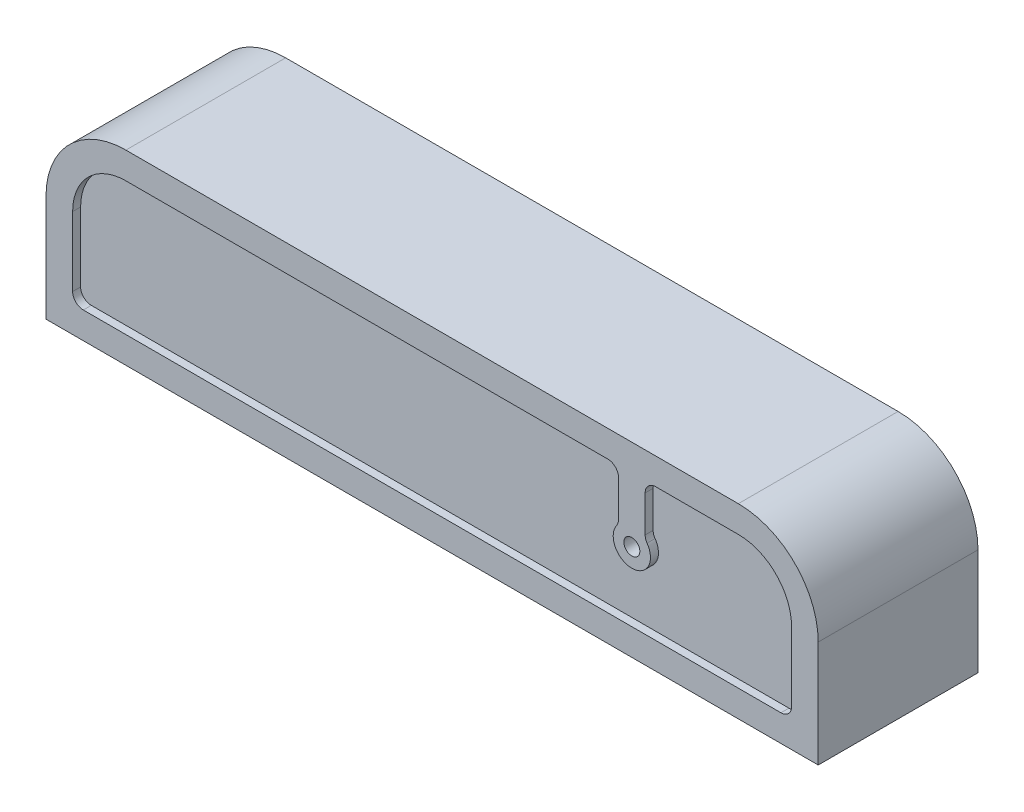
ISO-10303-21;
HEADER;
FILE_DESCRIPTION(('STEP AP214'),'2;1');
FILE_NAME('part.step','',(''),(''),'','','');
FILE_SCHEMA(('AUTOMOTIVE_DESIGN { 1 0 10303 214 1 1 1 1 }'));
ENDSEC;
DATA;
#1=APPLICATION_CONTEXT('core data for automotive mechanical design processes');
#2=APPLICATION_PROTOCOL_DEFINITION('international standard','automotive_design',2000,#1);
#3=PRODUCT_CONTEXT('',#1,'mechanical');
#4=PRODUCT('Part','Part','',(#3));
#5=PRODUCT_RELATED_PRODUCT_CATEGORY('part','',(#4));
#6=PRODUCT_DEFINITION_FORMATION('','',#4);
#7=PRODUCT_DEFINITION_CONTEXT('part definition',#1,'design');
#8=PRODUCT_DEFINITION('design','',#6,#7);
#9=PRODUCT_DEFINITION_SHAPE('','',#8);
#10=(LENGTH_UNIT() NAMED_UNIT(*) SI_UNIT(.MILLI.,.METRE.));
#11=(NAMED_UNIT(*) PLANE_ANGLE_UNIT() SI_UNIT($,.RADIAN.));
#12=(NAMED_UNIT(*) SI_UNIT($,.STERADIAN.) SOLID_ANGLE_UNIT());
#13=UNCERTAINTY_MEASURE_WITH_UNIT(LENGTH_MEASURE(1.E-05),#10,'distance_accuracy_value','');
#14=(GEOMETRIC_REPRESENTATION_CONTEXT(3) GLOBAL_UNCERTAINTY_ASSIGNED_CONTEXT((#13)) GLOBAL_UNIT_ASSIGNED_CONTEXT((#10,
#11,#12)) REPRESENTATION_CONTEXT('',''));
#15=CARTESIAN_POINT('',(0.,0.,0.));
#16=DIRECTION('',(0.,0.,1.));
#17=DIRECTION('',(1.,0.,0.));
#18=AXIS2_PLACEMENT_3D('',#15,#16,#17);
#19=CARTESIAN_POINT('',(-72.5,0.,90.));
#20=DIRECTION('',(1.,0.,0.));
#21=DIRECTION('',(0.,1.,0.));
#22=AXIS2_PLACEMENT_3D('',#19,#20,#21);
#23=PLANE('',#22);
#24=DIRECTION('',(0.,0.,-1.));
#25=VECTOR('',#24,1.);
#26=CARTESIAN_POINT('',(-72.5,20.,90.));
#27=LINE('',#26,#25);
#28=CARTESIAN_POINT('',(-72.5,20.,90.));
#29=VERTEX_POINT('',#28);
#30=CARTESIAN_POINT('',(-72.5,20.,60.));
#31=VERTEX_POINT('',#30);
#32=EDGE_CURVE('E302',#29,#31,#27,.T.);
#33=ORIENTED_EDGE('',*,*,#32,.T.);
#34=DIRECTION('',(0.,-1.,0.));
#35=VECTOR('',#34,1.);
#36=CARTESIAN_POINT('',(-72.5,20.,60.));
#37=LINE('',#36,#35);
#38=CARTESIAN_POINT('',(-72.5,0.,60.));
#39=VERTEX_POINT('',#38);
#40=EDGE_CURVE('E328',#31,#39,#37,.T.);
#41=ORIENTED_EDGE('',*,*,#40,.T.);
#42=DIRECTION('',(0.,0.,-1.));
#43=VECTOR('',#42,1.);
#44=CARTESIAN_POINT('',(-72.5,0.,90.));
#45=LINE('',#44,#43);
#46=CARTESIAN_POINT('',(-72.5,0.,90.));
#47=VERTEX_POINT('',#46);
#48=EDGE_CURVE('E45',#47,#39,#45,.T.);
#49=ORIENTED_EDGE('',*,*,#48,.F.);
#50=DIRECTION('',(0.,-1.,0.));
#51=VECTOR('',#50,1.);
#52=CARTESIAN_POINT('',(-72.5,0.,90.));
#53=LINE('',#52,#51);
#54=EDGE_CURVE('E287',#29,#47,#53,.T.);
#55=ORIENTED_EDGE('',*,*,#54,.F.);
#56=EDGE_LOOP('',(#33,#41,#49,#55));
#57=FACE_BOUND('',#56,.T.);
#58=ADVANCED_FACE('F38',(#57),#23,.F.);
#59=CARTESIAN_POINT('',(72.5,0.,90.));
#60=DIRECTION('',(0.,1.,0.));
#61=DIRECTION('',(0.,0.,1.));
#62=AXIS2_PLACEMENT_3D('',#59,#60,#61);
#63=PLANE('',#62);
#64=ORIENTED_EDGE('',*,*,#48,.T.);
#65=DIRECTION('',(1.,0.,0.));
#66=VECTOR('',#65,1.);
#67=CARTESIAN_POINT('',(-72.5,0.,60.));
#68=LINE('',#67,#66);
#69=CARTESIAN_POINT('',(-66.5,0.,60.));
#70=VERTEX_POINT('',#69);
#71=EDGE_CURVE('E322',#39,#70,#68,.T.);
#72=ORIENTED_EDGE('',*,*,#71,.T.);
#73=DIRECTION('',(0.,0.,-1.));
#74=VECTOR('',#73,1.);
#75=CARTESIAN_POINT('',(-66.5,0.,78.5));
#76=LINE('',#75,#74);
#77=CARTESIAN_POINT('',(-66.5,0.,78.5));
#78=VERTEX_POINT('',#77);
#79=EDGE_CURVE('E527',#78,#70,#76,.T.);
#80=ORIENTED_EDGE('',*,*,#79,.F.);
#81=CARTESIAN_POINT('',(-63.5,0.,78.5));
#82=DIRECTION('',(0.,-1.,0.));
#83=DIRECTION('',(0.,0.,-1.));
#84=AXIS2_PLACEMENT_3D('',#81,#82,#83);
#85=CIRCLE('',#84,3.);
#86=CARTESIAN_POINT('',(-63.5,0.,81.5));
#87=VERTEX_POINT('',#86);
#88=EDGE_CURVE('E524',#87,#78,#85,.T.);
#89=ORIENTED_EDGE('',*,*,#88,.F.);
#90=DIRECTION('',(-1.,0.,0.));
#91=VECTOR('',#90,1.);
#92=CARTESIAN_POINT('',(-63.5,0.,81.5));
#93=LINE('',#92,#91);
#94=CARTESIAN_POINT('',(63.5,0.,81.5));
#95=VERTEX_POINT('',#94);
#96=EDGE_CURVE('E521',#95,#87,#93,.T.);
#97=ORIENTED_EDGE('',*,*,#96,.F.);
#98=CARTESIAN_POINT('',(63.5,0.,78.5));
#99=DIRECTION('',(0.,-1.,0.));
#100=DIRECTION('',(0.,0.,1.));
#101=AXIS2_PLACEMENT_3D('',#98,#99,#100);
#102=CIRCLE('',#101,3.);
#103=CARTESIAN_POINT('',(66.5,0.,78.5));
#104=VERTEX_POINT('',#103);
#105=EDGE_CURVE('E476',#104,#95,#102,.T.);
#106=ORIENTED_EDGE('',*,*,#105,.F.);
#107=DIRECTION('',(0.,0.,1.));
#108=VECTOR('',#107,1.);
#109=CARTESIAN_POINT('',(66.5,0.,78.5));
#110=LINE('',#109,#108);
#111=CARTESIAN_POINT('',(66.5,0.,60.));
#112=VERTEX_POINT('',#111);
#113=EDGE_CURVE('E511',#112,#104,#110,.T.);
#114=ORIENTED_EDGE('',*,*,#113,.F.);
#115=CARTESIAN_POINT('',(72.5,0.,60.));
#116=VERTEX_POINT('',#115);
#117=EDGE_CURVE('E331',#112,#116,#68,.T.);
#118=ORIENTED_EDGE('',*,*,#117,.T.);
#119=DIRECTION('',(0.,0.,-1.));
#120=VECTOR('',#119,1.);
#121=CARTESIAN_POINT('',(72.5,0.,90.));
#122=LINE('',#121,#120);
#123=CARTESIAN_POINT('',(72.5,0.,90.));
#124=VERTEX_POINT('',#123);
#125=EDGE_CURVE('E314',#124,#116,#122,.T.);
#126=ORIENTED_EDGE('',*,*,#125,.F.);
#127=DIRECTION('',(1.,0.,0.));
#128=VECTOR('',#127,1.);
#129=CARTESIAN_POINT('',(72.5,0.,90.));
#130=LINE('',#129,#128);
#131=EDGE_CURVE('E292',#47,#124,#130,.T.);
#132=ORIENTED_EDGE('',*,*,#131,.F.);
#133=EDGE_LOOP('',(#64,#72,#80,#89,#97,#106,#114,#118,#126,#132));
#134=FACE_BOUND('',#133,.T.);
#135=ADVANCED_FACE('F320',(#134),#63,.F.);
#136=CARTESIAN_POINT('',(72.5,20.,90.));
#137=DIRECTION('',(-1.,0.,0.));
#138=DIRECTION('',(0.,-1.,0.));
#139=AXIS2_PLACEMENT_3D('',#136,#137,#138);
#140=PLANE('',#139);
#141=ORIENTED_EDGE('',*,*,#125,.T.);
#142=DIRECTION('',(0.,1.,0.));
#143=VECTOR('',#142,1.);
#144=CARTESIAN_POINT('',(72.5,0.,60.));
#145=LINE('',#144,#143);
#146=CARTESIAN_POINT('',(72.5,20.,60.));
#147=VERTEX_POINT('',#146);
#148=EDGE_CURVE('E340',#116,#147,#145,.T.);
#149=ORIENTED_EDGE('',*,*,#148,.T.);
#150=DIRECTION('',(0.,0.,-1.));
#151=VECTOR('',#150,1.);
#152=CARTESIAN_POINT('',(72.5,20.,90.));
#153=LINE('',#152,#151);
#154=CARTESIAN_POINT('',(72.5,20.,90.));
#155=VERTEX_POINT('',#154);
#156=EDGE_CURVE('E311',#155,#147,#153,.T.);
#157=ORIENTED_EDGE('',*,*,#156,.F.);
#158=DIRECTION('',(0.,1.,0.));
#159=VECTOR('',#158,1.);
#160=CARTESIAN_POINT('',(72.5,20.,90.));
#161=LINE('',#160,#159);
#162=EDGE_CURVE('E294',#124,#155,#161,.T.);
#163=ORIENTED_EDGE('',*,*,#162,.F.);
#164=EDGE_LOOP('',(#141,#149,#157,#163));
#165=FACE_BOUND('',#164,.T.);
#166=ADVANCED_FACE('F557',(#165),#140,.F.);
#167=CARTESIAN_POINT('',(57.5,20.,90.));
#168=DIRECTION('',(0.,0.,-1.));
#169=DIRECTION('',(-1.,0.,0.));
#170=AXIS2_PLACEMENT_3D('',#167,#168,#169);
#171=CYLINDRICAL_SURFACE('',#170,15.);
#172=ORIENTED_EDGE('',*,*,#156,.T.);
#173=CARTESIAN_POINT('',(57.5,20.,60.));
#174=DIRECTION('',(0.,0.,1.));
#175=DIRECTION('',(1.,0.,0.));
#176=AXIS2_PLACEMENT_3D('',#173,#174,#175);
#177=CIRCLE('',#176,15.);
#178=CARTESIAN_POINT('',(57.5,35.,60.));
#179=VERTEX_POINT('',#178);
#180=EDGE_CURVE('E343',#147,#179,#177,.T.);
#181=ORIENTED_EDGE('',*,*,#180,.T.);
#182=DIRECTION('',(0.,0.,-1.));
#183=VECTOR('',#182,1.);
#184=CARTESIAN_POINT('',(57.5,35.,90.));
#185=LINE('',#184,#183);
#186=CARTESIAN_POINT('',(57.5,35.,90.));
#187=VERTEX_POINT('',#186);
#188=EDGE_CURVE('E308',#187,#179,#185,.T.);
#189=ORIENTED_EDGE('',*,*,#188,.F.);
#190=CARTESIAN_POINT('',(57.5,20.,90.));
#191=DIRECTION('',(0.,0.,1.));
#192=DIRECTION('',(-1.,0.,0.));
#193=AXIS2_PLACEMENT_3D('',#190,#191,#192);
#194=CIRCLE('',#193,15.);
#195=EDGE_CURVE('E296',#155,#187,#194,.T.);
#196=ORIENTED_EDGE('',*,*,#195,.F.);
#197=EDGE_LOOP('',(#172,#181,#189,#196));
#198=FACE_BOUND('',#197,.T.);
#199=ADVANCED_FACE('F571',(#198),#171,.T.);
#200=CARTESIAN_POINT('',(-57.5,35.,90.));
#201=DIRECTION('',(0.,-1.,0.));
#202=DIRECTION('',(1.,0.,0.));
#203=AXIS2_PLACEMENT_3D('',#200,#201,#202);
#204=PLANE('',#203);
#205=ORIENTED_EDGE('',*,*,#188,.T.);
#206=DIRECTION('',(-1.,0.,0.));
#207=VECTOR('',#206,1.);
#208=CARTESIAN_POINT('',(57.5,35.,60.));
#209=LINE('',#208,#207);
#210=CARTESIAN_POINT('',(-57.5,35.,60.));
#211=VERTEX_POINT('',#210);
#212=EDGE_CURVE('E253',#179,#211,#209,.T.);
#213=ORIENTED_EDGE('',*,*,#212,.T.);
#214=DIRECTION('',(0.,0.,-1.));
#215=VECTOR('',#214,1.);
#216=CARTESIAN_POINT('',(-57.5,35.,90.));
#217=LINE('',#216,#215);
#218=CARTESIAN_POINT('',(-57.5,35.,90.));
#219=VERTEX_POINT('',#218);
#220=EDGE_CURVE('E305',#219,#211,#217,.T.);
#221=ORIENTED_EDGE('',*,*,#220,.F.);
#222=DIRECTION('',(-1.,0.,0.));
#223=VECTOR('',#222,1.);
#224=CARTESIAN_POINT('',(-57.5,35.,90.));
#225=LINE('',#224,#223);
#226=EDGE_CURVE('E298',#187,#219,#225,.T.);
#227=ORIENTED_EDGE('',*,*,#226,.F.);
#228=EDGE_LOOP('',(#205,#213,#221,#227));
#229=FACE_BOUND('',#228,.T.);
#230=ADVANCED_FACE('F569',(#229),#204,.F.);
#231=CARTESIAN_POINT('',(-57.5,20.,90.));
#232=DIRECTION('',(0.,0.,-1.));
#233=DIRECTION('',(-1.,0.,0.));
#234=AXIS2_PLACEMENT_3D('',#231,#232,#233);
#235=CYLINDRICAL_SURFACE('',#234,15.);
#236=ORIENTED_EDGE('',*,*,#220,.T.);
#237=CARTESIAN_POINT('',(-57.5,20.,60.));
#238=DIRECTION('',(0.,0.,1.));
#239=DIRECTION('',(1.,0.,0.));
#240=AXIS2_PLACEMENT_3D('',#237,#238,#239);
#241=CIRCLE('',#240,15.);
#242=EDGE_CURVE('E332',#211,#31,#241,.T.);
#243=ORIENTED_EDGE('',*,*,#242,.T.);
#244=ORIENTED_EDGE('',*,*,#32,.F.);
#245=CARTESIAN_POINT('',(-57.5,20.,90.));
#246=DIRECTION('',(0.,0.,1.));
#247=DIRECTION('',(-1.,0.,0.));
#248=AXIS2_PLACEMENT_3D('',#245,#246,#247);
#249=CIRCLE('',#248,15.);
#250=EDGE_CURVE('E300',#219,#29,#249,.T.);
#251=ORIENTED_EDGE('',*,*,#250,.F.);
#252=EDGE_LOOP('',(#236,#243,#244,#251));
#253=FACE_BOUND('',#252,.T.);
#254=ADVANCED_FACE('F567',(#253),#235,.T.);
#255=CARTESIAN_POINT('',(-57.5,20.,90.));
#256=DIRECTION('',(0.,0.,-1.));
#257=DIRECTION('',(-1.,0.,0.));
#258=AXIS2_PLACEMENT_3D('',#255,#256,#257);
#259=PLANE('',#258);
#260=CARTESIAN_POINT('',(37.5,18.,90.));
#261=DIRECTION('',(0.,0.,1.));
#262=DIRECTION('',(1.,0.,0.));
#263=AXIS2_PLACEMENT_3D('',#260,#261,#262);
#264=CIRCLE('',#263,1.5);
#265=CARTESIAN_POINT('',(39.,18.,90.));
#266=VERTEX_POINT('',#265);
#267=EDGE_CURVE('E372',#266,#266,#264,.T.);
#268=ORIENTED_EDGE('',*,*,#267,.F.);
#269=EDGE_LOOP('',(#268));
#270=FACE_BOUND('',#269,.T.);
#271=DIRECTION('',(0.,-1.,0.));
#272=VECTOR('',#271,1.);
#273=CARTESIAN_POINT('',(-67.5,20.,90.));
#274=LINE('',#273,#272);
#275=CARTESIAN_POINT('',(-67.5,20.,90.));
#276=VERTEX_POINT('',#275);
#277=CARTESIAN_POINT('',(-67.5,7.00000000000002,90.));
#278=VERTEX_POINT('',#277);
#279=EDGE_CURVE('E430',#276,#278,#274,.T.);
#280=ORIENTED_EDGE('',*,*,#279,.F.);
#281=CARTESIAN_POINT('',(-57.5,20.,90.));
#282=DIRECTION('',(0.,0.,1.));
#283=DIRECTION('',(1.,0.,0.));
#284=AXIS2_PLACEMENT_3D('',#281,#282,#283);
#285=CIRCLE('',#284,9.99999999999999);
#286=CARTESIAN_POINT('',(-57.5,30.,90.));
#287=VERTEX_POINT('',#286);
#288=EDGE_CURVE('E378',#287,#276,#285,.T.);
#289=ORIENTED_EDGE('',*,*,#288,.F.);
#290=DIRECTION('',(-1.,0.,0.));
#291=VECTOR('',#290,1.);
#292=CARTESIAN_POINT('',(33.,30.,90.));
#293=LINE('',#292,#291);
#294=CARTESIAN_POINT('',(33.,30.,90.));
#295=VERTEX_POINT('',#294);
#296=EDGE_CURVE('E383',#295,#287,#293,.T.);
#297=ORIENTED_EDGE('',*,*,#296,.F.);
#298=CARTESIAN_POINT('',(33.,28.,90.));
#299=DIRECTION('',(0.,0.,1.));
#300=DIRECTION('',(1.,0.,0.));
#301=AXIS2_PLACEMENT_3D('',#298,#299,#300);
#302=CIRCLE('',#301,2.);
#303=CARTESIAN_POINT('',(35.,28.,90.));
#304=VERTEX_POINT('',#303);
#305=EDGE_CURVE('E469',#304,#295,#302,.T.);
#306=ORIENTED_EDGE('',*,*,#305,.F.);
#307=DIRECTION('',(0.,1.,0.));
#308=VECTOR('',#307,1.);
#309=CARTESIAN_POINT('',(35.,28.,90.));
#310=LINE('',#309,#308);
#311=CARTESIAN_POINT('',(35.,21.1622776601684,90.));
#312=VERTEX_POINT('',#311);
#313=EDGE_CURVE('E466',#312,#304,#310,.T.);
#314=ORIENTED_EDGE('',*,*,#313,.F.);
#315=CARTESIAN_POINT('',(33.,21.1622776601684,90.));
#316=DIRECTION('',(0.,0.,1.));
#317=DIRECTION('',(1.,0.,0.));
#318=AXIS2_PLACEMENT_3D('',#315,#316,#317);
#319=CIRCLE('',#318,2.);
#320=CARTESIAN_POINT('',(34.6363636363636,20.0123585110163,90.));
#321=VERTEX_POINT('',#320);
#322=EDGE_CURVE('E463',#321,#312,#319,.T.);
#323=ORIENTED_EDGE('',*,*,#322,.F.);
#324=CARTESIAN_POINT('',(37.5,18.,90.));
#325=DIRECTION('',(0.,0.,-1.));
#326=DIRECTION('',(1.,0.,0.));
#327=AXIS2_PLACEMENT_3D('',#324,#325,#326);
#328=CIRCLE('',#327,3.50000000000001);
#329=CARTESIAN_POINT('',(40.3636363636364,20.0123585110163,90.));
#330=VERTEX_POINT('',#329);
#331=EDGE_CURVE('E460',#330,#321,#328,.T.);
#332=ORIENTED_EDGE('',*,*,#331,.F.);
#333=CARTESIAN_POINT('',(42.,21.1622776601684,90.));
#334=DIRECTION('',(0.,0.,1.));
#335=DIRECTION('',(1.,0.,0.));
#336=AXIS2_PLACEMENT_3D('',#333,#334,#335);
#337=CIRCLE('',#336,2.);
#338=CARTESIAN_POINT('',(40.,21.1622776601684,90.));
#339=VERTEX_POINT('',#338);
#340=EDGE_CURVE('E457',#339,#330,#337,.T.);
#341=ORIENTED_EDGE('',*,*,#340,.F.);
#342=DIRECTION('',(0.,-1.,0.));
#343=VECTOR('',#342,1.);
#344=CARTESIAN_POINT('',(40.,28.,90.));
#345=LINE('',#344,#343);
#346=CARTESIAN_POINT('',(40.,28.,90.));
#347=VERTEX_POINT('',#346);
#348=EDGE_CURVE('E454',#347,#339,#345,.T.);
#349=ORIENTED_EDGE('',*,*,#348,.F.);
#350=CARTESIAN_POINT('',(42.,28.,90.));
#351=DIRECTION('',(0.,0.,1.));
#352=DIRECTION('',(-1.,0.,0.));
#353=AXIS2_PLACEMENT_3D('',#350,#351,#352);
#354=CIRCLE('',#353,2.00000000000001);
#355=CARTESIAN_POINT('',(42.,30.,90.));
#356=VERTEX_POINT('',#355);
#357=EDGE_CURVE('E451',#356,#347,#354,.T.);
#358=ORIENTED_EDGE('',*,*,#357,.F.);
#359=DIRECTION('',(-1.,0.,0.));
#360=VECTOR('',#359,1.);
#361=CARTESIAN_POINT('',(57.5,30.,90.));
#362=LINE('',#361,#360);
#363=CARTESIAN_POINT('',(57.5,30.,90.));
#364=VERTEX_POINT('',#363);
#365=EDGE_CURVE('E448',#364,#356,#362,.T.);
#366=ORIENTED_EDGE('',*,*,#365,.F.);
#367=CARTESIAN_POINT('',(57.5,20.,90.));
#368=DIRECTION('',(0.,0.,1.));
#369=DIRECTION('',(1.,0.,0.));
#370=AXIS2_PLACEMENT_3D('',#367,#368,#369);
#371=CIRCLE('',#370,10.);
#372=CARTESIAN_POINT('',(67.5,20.,90.));
#373=VERTEX_POINT('',#372);
#374=EDGE_CURVE('E445',#373,#364,#371,.T.);
#375=ORIENTED_EDGE('',*,*,#374,.F.);
#376=DIRECTION('',(0.,1.,0.));
#377=VECTOR('',#376,1.);
#378=CARTESIAN_POINT('',(67.5,7.00000000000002,90.));
#379=LINE('',#378,#377);
#380=CARTESIAN_POINT('',(67.5,7.,90.));
#381=VERTEX_POINT('',#380);
#382=EDGE_CURVE('E442',#381,#373,#379,.T.);
#383=ORIENTED_EDGE('',*,*,#382,.F.);
#384=CARTESIAN_POINT('',(65.5,7.,90.));
#385=DIRECTION('',(0.,0.,1.));
#386=DIRECTION('',(1.,0.,0.));
#387=AXIS2_PLACEMENT_3D('',#384,#385,#386);
#388=CIRCLE('',#387,2.);
#389=CARTESIAN_POINT('',(65.5,5.,90.));
#390=VERTEX_POINT('',#389);
#391=EDGE_CURVE('E439',#390,#381,#388,.T.);
#392=ORIENTED_EDGE('',*,*,#391,.F.);
#393=DIRECTION('',(1.,0.,0.));
#394=VECTOR('',#393,1.);
#395=CARTESIAN_POINT('',(-65.5,5.,90.));
#396=LINE('',#395,#394);
#397=CARTESIAN_POINT('',(-65.5,5.,90.));
#398=VERTEX_POINT('',#397);
#399=EDGE_CURVE('E436',#398,#390,#396,.T.);
#400=ORIENTED_EDGE('',*,*,#399,.F.);
#401=CARTESIAN_POINT('',(-65.5,7.,90.));
#402=DIRECTION('',(0.,0.,1.));
#403=DIRECTION('',(1.,0.,0.));
#404=AXIS2_PLACEMENT_3D('',#401,#402,#403);
#405=CIRCLE('',#404,2.);
#406=EDGE_CURVE('E433',#278,#398,#405,.T.);
#407=ORIENTED_EDGE('',*,*,#406,.F.);
#408=EDGE_LOOP('',(#280,#289,#297,#306,#314,#323,#332,#341,#349,#358,#366,#375,#383,#392,#400,#407));
#409=FACE_BOUND('',#408,.T.);
#410=ORIENTED_EDGE('',*,*,#54,.T.);
#411=ORIENTED_EDGE('',*,*,#131,.T.);
#412=ORIENTED_EDGE('',*,*,#162,.T.);
#413=ORIENTED_EDGE('',*,*,#195,.T.);
#414=ORIENTED_EDGE('',*,*,#226,.T.);
#415=ORIENTED_EDGE('',*,*,#250,.T.);
#416=EDGE_LOOP('',(#410,#411,#412,#413,#414,#415));
#417=FACE_BOUND('',#416,.T.);
#418=ADVANCED_FACE('F561',(#270,#409,#417),#259,.F.);
#419=CARTESIAN_POINT('',(63.5,2.5,78.5));
#420=DIRECTION('',(0.,1.,0.));
#421=DIRECTION('',(0.,0.,1.));
#422=AXIS2_PLACEMENT_3D('',#419,#420,#421);
#423=PLANE('',#422);
#424=CARTESIAN_POINT('',(62.5,2.5,77.5));
#425=DIRECTION('',(0.,-1.,0.));
#426=DIRECTION('',(0.,0.,-1.));
#427=AXIS2_PLACEMENT_3D('',#424,#425,#426);
#428=CIRCLE('',#427,2.);
#429=CARTESIAN_POINT('',(62.5,2.5,75.5));
#430=VERTEX_POINT('',#429);
#431=EDGE_CURVE('E361',#430,#430,#428,.T.);
#432=ORIENTED_EDGE('',*,*,#431,.F.);
#433=EDGE_LOOP('',(#432));
#434=FACE_BOUND('',#433,.T.);
#435=CARTESIAN_POINT('',(-62.5,2.5,77.5));
#436=DIRECTION('',(0.,-1.,0.));
#437=DIRECTION('',(0.,0.,-1.));
#438=AXIS2_PLACEMENT_3D('',#435,#436,#437);
#439=CIRCLE('',#438,2.);
#440=CARTESIAN_POINT('',(-62.5,2.5,75.5));
#441=VERTEX_POINT('',#440);
#442=EDGE_CURVE('E365',#441,#441,#439,.T.);
#443=ORIENTED_EDGE('',*,*,#442,.F.);
#444=EDGE_LOOP('',(#443));
#445=FACE_BOUND('',#444,.T.);
#446=DIRECTION('',(0.,0.,-1.));
#447=VECTOR('',#446,1.);
#448=CARTESIAN_POINT('',(-66.5,2.5,78.5));
#449=LINE('',#448,#447);
#450=CARTESIAN_POINT('',(-66.5,2.5,78.5));
#451=VERTEX_POINT('',#450);
#452=CARTESIAN_POINT('',(-66.5,2.5,60.));
#453=VERTEX_POINT('',#452);
#454=EDGE_CURVE('E263',#451,#453,#449,.T.);
#455=ORIENTED_EDGE('',*,*,#454,.T.);
#456=DIRECTION('',(-1.,0.,0.));
#457=VECTOR('',#456,1.);
#458=CARTESIAN_POINT('',(-57.5,2.5,60.));
#459=LINE('',#458,#457);
#460=CARTESIAN_POINT('',(-60.5,2.5,60.));
#461=VERTEX_POINT('',#460);
#462=EDGE_CURVE('E247',#461,#453,#459,.T.);
#463=ORIENTED_EDGE('',*,*,#462,.F.);
#464=DIRECTION('',(0.,0.,-1.));
#465=VECTOR('',#464,1.);
#466=CARTESIAN_POINT('',(-60.5,2.5,76.5));
#467=LINE('',#466,#465);
#468=CARTESIAN_POINT('',(-60.5,2.5,76.5));
#469=VERTEX_POINT('',#468);
#470=EDGE_CURVE('E259',#469,#461,#467,.T.);
#471=ORIENTED_EDGE('',*,*,#470,.F.);
#472=DIRECTION('',(-1.,0.,0.));
#473=VECTOR('',#472,1.);
#474=CARTESIAN_POINT('',(-60.5,2.5,76.5));
#475=LINE('',#474,#473);
#476=CARTESIAN_POINT('',(60.5,2.5,76.5));
#477=VERTEX_POINT('',#476);
#478=EDGE_CURVE('E272',#477,#469,#475,.T.);
#479=ORIENTED_EDGE('',*,*,#478,.F.);
#480=DIRECTION('',(0.,0.,1.));
#481=VECTOR('',#480,1.);
#482=CARTESIAN_POINT('',(60.5,2.5,76.5));
#483=LINE('',#482,#481);
#484=CARTESIAN_POINT('',(60.5,2.5,60.));
#485=VERTEX_POINT('',#484);
#486=EDGE_CURVE('E11',#485,#477,#483,.T.);
#487=ORIENTED_EDGE('',*,*,#486,.F.);
#488=CARTESIAN_POINT('',(66.5,2.5,60.));
#489=VERTEX_POINT('',#488);
#490=EDGE_CURVE('E266',#489,#485,#459,.T.);
#491=ORIENTED_EDGE('',*,*,#490,.F.);
#492=DIRECTION('',(0.,0.,1.));
#493=VECTOR('',#492,1.);
#494=CARTESIAN_POINT('',(66.5,2.5,78.5));
#495=LINE('',#494,#493);
#496=CARTESIAN_POINT('',(66.5,2.5,78.5));
#497=VERTEX_POINT('',#496);
#498=EDGE_CURVE('E517',#489,#497,#495,.T.);
#499=ORIENTED_EDGE('',*,*,#498,.T.);
#500=CARTESIAN_POINT('',(63.5,2.5,78.5));
#501=DIRECTION('',(0.,-1.,0.));
#502=DIRECTION('',(0.,0.,1.));
#503=AXIS2_PLACEMENT_3D('',#500,#501,#502);
#504=CIRCLE('',#503,3.);
#505=CARTESIAN_POINT('',(63.5,2.5,81.5));
#506=VERTEX_POINT('',#505);
#507=EDGE_CURVE('E507',#497,#506,#504,.T.);
#508=ORIENTED_EDGE('',*,*,#507,.T.);
#509=DIRECTION('',(-1.,0.,0.));
#510=VECTOR('',#509,1.);
#511=CARTESIAN_POINT('',(-63.5,2.5,81.5));
#512=LINE('',#511,#510);
#513=CARTESIAN_POINT('',(-63.5,2.5,81.5));
#514=VERTEX_POINT('',#513);
#515=EDGE_CURVE('E510',#506,#514,#512,.T.);
#516=ORIENTED_EDGE('',*,*,#515,.T.);
#517=CARTESIAN_POINT('',(-63.5,2.5,78.5));
#518=DIRECTION('',(0.,-1.,0.));
#519=DIRECTION('',(0.,0.,-1.));
#520=AXIS2_PLACEMENT_3D('',#517,#518,#519);
#521=CIRCLE('',#520,3.);
#522=EDGE_CURVE('E514',#514,#451,#521,.T.);
#523=ORIENTED_EDGE('',*,*,#522,.T.);
#524=EDGE_LOOP('',(#455,#463,#471,#479,#487,#491,#499,#508,#516,#523));
#525=FACE_BOUND('',#524,.T.);
#526=ADVANCED_FACE('F257',(#434,#445,#525),#423,.F.);
#527=CARTESIAN_POINT('',(63.5,2.5,78.5));
#528=DIRECTION('',(0.,-1.,0.));
#529=DIRECTION('',(0.,0.,-1.));
#530=AXIS2_PLACEMENT_3D('',#527,#528,#529);
#531=CYLINDRICAL_SURFACE('',#530,3.);
#532=ORIENTED_EDGE('',*,*,#105,.T.);
#533=DIRECTION('',(0.,-1.,0.));
#534=VECTOR('',#533,1.);
#535=CARTESIAN_POINT('',(63.5,2.5,81.5));
#536=LINE('',#535,#534);
#537=EDGE_CURVE('E519',#506,#95,#536,.T.);
#538=ORIENTED_EDGE('',*,*,#537,.F.);
#539=ORIENTED_EDGE('',*,*,#507,.F.);
#540=DIRECTION('',(0.,-1.,0.));
#541=VECTOR('',#540,1.);
#542=CARTESIAN_POINT('',(66.5,2.5,78.5));
#543=LINE('',#542,#541);
#544=EDGE_CURVE('E276',#497,#104,#543,.T.);
#545=ORIENTED_EDGE('',*,*,#544,.T.);
#546=EDGE_LOOP('',(#532,#538,#539,#545));
#547=FACE_BOUND('',#546,.T.);
#548=ADVANCED_FACE('F551',(#547),#531,.F.);
#549=CARTESIAN_POINT('',(66.5,2.5,78.5));
#550=DIRECTION('',(1.,0.,0.));
#551=DIRECTION('',(0.,0.,-1.));
#552=AXIS2_PLACEMENT_3D('',#549,#550,#551);
#553=PLANE('',#552);
#554=ORIENTED_EDGE('',*,*,#498,.F.);
#555=DIRECTION('',(0.,1.,0.));
#556=VECTOR('',#555,1.);
#557=CARTESIAN_POINT('',(66.5,20.,60.));
#558=LINE('',#557,#556);
#559=EDGE_CURVE('E352',#112,#489,#558,.T.);
#560=ORIENTED_EDGE('',*,*,#559,.F.);
#561=ORIENTED_EDGE('',*,*,#113,.T.);
#562=ORIENTED_EDGE('',*,*,#544,.F.);
#563=EDGE_LOOP('',(#554,#560,#561,#562));
#564=FACE_BOUND('',#563,.T.);
#565=ADVANCED_FACE('F553',(#564),#553,.F.);
#566=CARTESIAN_POINT('',(-66.5,2.5,78.5));
#567=DIRECTION('',(-1.,0.,0.));
#568=DIRECTION('',(0.,0.,1.));
#569=AXIS2_PLACEMENT_3D('',#566,#567,#568);
#570=PLANE('',#569);
#571=ORIENTED_EDGE('',*,*,#79,.T.);
#572=DIRECTION('',(0.,-1.,0.));
#573=VECTOR('',#572,1.);
#574=CARTESIAN_POINT('',(-66.5,20.,60.));
#575=LINE('',#574,#573);
#576=EDGE_CURVE('E350',#453,#70,#575,.T.);
#577=ORIENTED_EDGE('',*,*,#576,.F.);
#578=ORIENTED_EDGE('',*,*,#454,.F.);
#579=DIRECTION('',(0.,-1.,0.));
#580=VECTOR('',#579,1.);
#581=CARTESIAN_POINT('',(-66.5,2.5,78.5));
#582=LINE('',#581,#580);
#583=EDGE_CURVE('E532',#451,#78,#582,.T.);
#584=ORIENTED_EDGE('',*,*,#583,.T.);
#585=EDGE_LOOP('',(#571,#577,#578,#584));
#586=FACE_BOUND('',#585,.T.);
#587=ADVANCED_FACE('F606',(#586),#570,.F.);
#588=CARTESIAN_POINT('',(-63.5,2.5,78.5));
#589=DIRECTION('',(0.,-1.,0.));
#590=DIRECTION('',(0.,0.,-1.));
#591=AXIS2_PLACEMENT_3D('',#588,#589,#590);
#592=CYLINDRICAL_SURFACE('',#591,3.);
#593=ORIENTED_EDGE('',*,*,#88,.T.);
#594=ORIENTED_EDGE('',*,*,#583,.F.);
#595=ORIENTED_EDGE('',*,*,#522,.F.);
#596=DIRECTION('',(0.,-1.,0.));
#597=VECTOR('',#596,1.);
#598=CARTESIAN_POINT('',(-63.5,2.5,81.5));
#599=LINE('',#598,#597);
#600=EDGE_CURVE('E534',#514,#87,#599,.T.);
#601=ORIENTED_EDGE('',*,*,#600,.T.);
#602=EDGE_LOOP('',(#593,#594,#595,#601));
#603=FACE_BOUND('',#602,.T.);
#604=ADVANCED_FACE('F546',(#603),#592,.F.);
#605=CARTESIAN_POINT('',(-63.5,2.5,81.5));
#606=DIRECTION('',(0.,0.,1.));
#607=DIRECTION('',(1.,0.,0.));
#608=AXIS2_PLACEMENT_3D('',#605,#606,#607);
#609=PLANE('',#608);
#610=ORIENTED_EDGE('',*,*,#96,.T.);
#611=ORIENTED_EDGE('',*,*,#600,.F.);
#612=ORIENTED_EDGE('',*,*,#515,.F.);
#613=ORIENTED_EDGE('',*,*,#537,.T.);
#614=EDGE_LOOP('',(#610,#611,#612,#613));
#615=FACE_BOUND('',#614,.T.);
#616=ADVANCED_FACE('F539',(#615),#609,.F.);
#617=CARTESIAN_POINT('',(0.,20.,0.));
#618=DIRECTION('',(0.,1.,0.));
#619=DIRECTION('',(0.,0.,1.));
#620=AXIS2_PLACEMENT_3D('',#617,#618,#619);
#621=PLANE('',#620);
#622=DIRECTION('',(0.,0.,-1.));
#623=VECTOR('',#622,1.);
#624=CARTESIAN_POINT('',(-60.5,20.,76.5));
#625=LINE('',#624,#623);
#626=CARTESIAN_POINT('',(-60.5,20.,76.5));
#627=VERTEX_POINT('',#626);
#628=CARTESIAN_POINT('',(-60.5,20.,60.));
#629=VERTEX_POINT('',#628);
#630=EDGE_CURVE('E283',#627,#629,#625,.T.);
#631=ORIENTED_EDGE('',*,*,#630,.T.);
#632=DIRECTION('',(-1.,0.,0.));
#633=VECTOR('',#632,1.);
#634=CARTESIAN_POINT('',(-57.5,20.,60.));
#635=LINE('',#634,#633);
#636=CARTESIAN_POINT('',(60.5,20.,60.));
#637=VERTEX_POINT('',#636);
#638=EDGE_CURVE('E52',#637,#629,#635,.T.);
#639=ORIENTED_EDGE('',*,*,#638,.F.);
#640=DIRECTION('',(0.,0.,1.));
#641=VECTOR('',#640,1.);
#642=CARTESIAN_POINT('',(60.5,20.,76.5));
#643=LINE('',#642,#641);
#644=CARTESIAN_POINT('',(60.5,20.,76.5));
#645=VERTEX_POINT('',#644);
#646=EDGE_CURVE('E271',#637,#645,#643,.T.);
#647=ORIENTED_EDGE('',*,*,#646,.T.);
#648=DIRECTION('',(-1.,0.,0.));
#649=VECTOR('',#648,1.);
#650=CARTESIAN_POINT('',(-60.5,20.,76.5));
#651=LINE('',#650,#649);
#652=CARTESIAN_POINT('',(37.5,20.,76.5));
#653=VERTEX_POINT('',#652);
#654=EDGE_CURVE('E280',#645,#653,#651,.T.);
#655=ORIENTED_EDGE('',*,*,#654,.T.);
#656=EDGE_CURVE('E274',#653,#627,#651,.T.);
#657=ORIENTED_EDGE('',*,*,#656,.T.);
#658=EDGE_LOOP('',(#631,#639,#647,#655,#657));
#659=FACE_BOUND('',#658,.T.);
#660=ADVANCED_FACE('F620',(#659),#621,.F.);
#661=CARTESIAN_POINT('',(60.5,20.,76.5));
#662=DIRECTION('',(1.,0.,0.));
#663=DIRECTION('',(0.,0.,-1.));
#664=AXIS2_PLACEMENT_3D('',#661,#662,#663);
#665=PLANE('',#664);
#666=ORIENTED_EDGE('',*,*,#646,.F.);
#667=DIRECTION('',(0.,1.,0.));
#668=VECTOR('',#667,1.);
#669=CARTESIAN_POINT('',(60.5,20.,60.));
#670=LINE('',#669,#668);
#671=EDGE_CURVE('E264',#485,#637,#670,.T.);
#672=ORIENTED_EDGE('',*,*,#671,.F.);
#673=ORIENTED_EDGE('',*,*,#486,.T.);
#674=DIRECTION('',(0.,-1.,0.));
#675=VECTOR('',#674,1.);
#676=CARTESIAN_POINT('',(60.5,20.,76.5));
#677=LINE('',#676,#675);
#678=EDGE_CURVE('E285',#645,#477,#677,.T.);
#679=ORIENTED_EDGE('',*,*,#678,.F.);
#680=EDGE_LOOP('',(#666,#672,#673,#679));
#681=FACE_BOUND('',#680,.T.);
#682=ADVANCED_FACE('F624',(#681),#665,.F.);
#683=CARTESIAN_POINT('',(-60.5,20.,76.5));
#684=DIRECTION('',(0.,0.,1.));
#685=DIRECTION('',(1.,0.,0.));
#686=AXIS2_PLACEMENT_3D('',#683,#684,#685);
#687=PLANE('',#686);
#688=ORIENTED_EDGE('',*,*,#656,.F.);
#689=CARTESIAN_POINT('',(37.5,18.,76.5));
#690=DIRECTION('',(0.,0.,1.));
#691=DIRECTION('',(1.,0.,0.));
#692=AXIS2_PLACEMENT_3D('',#689,#690,#691);
#693=CIRCLE('',#692,2.);
#694=EDGE_CURVE('E58',#653,#653,#693,.F.);
#695=ORIENTED_EDGE('',*,*,#694,.F.);
#696=ORIENTED_EDGE('',*,*,#654,.F.);
#697=ORIENTED_EDGE('',*,*,#678,.T.);
#698=ORIENTED_EDGE('',*,*,#478,.T.);
#699=DIRECTION('',(0.,-1.,0.));
#700=VECTOR('',#699,1.);
#701=CARTESIAN_POINT('',(-60.5,20.,76.5));
#702=LINE('',#701,#700);
#703=EDGE_CURVE('E270',#627,#469,#702,.T.);
#704=ORIENTED_EDGE('',*,*,#703,.F.);
#705=EDGE_LOOP('',(#688,#695,#696,#697,#698,#704));
#706=FACE_BOUND('',#705,.T.);
#707=ADVANCED_FACE('F634',(#706),#687,.F.);
#708=CARTESIAN_POINT('',(-60.5,20.,76.5));
#709=DIRECTION('',(-1.,0.,0.));
#710=DIRECTION('',(0.,0.,1.));
#711=AXIS2_PLACEMENT_3D('',#708,#709,#710);
#712=PLANE('',#711);
#713=ORIENTED_EDGE('',*,*,#470,.T.);
#714=DIRECTION('',(0.,-1.,0.));
#715=VECTOR('',#714,1.);
#716=CARTESIAN_POINT('',(-60.5,20.,60.));
#717=LINE('',#716,#715);
#718=EDGE_CURVE('E244',#629,#461,#717,.T.);
#719=ORIENTED_EDGE('',*,*,#718,.F.);
#720=ORIENTED_EDGE('',*,*,#630,.F.);
#721=ORIENTED_EDGE('',*,*,#703,.T.);
#722=EDGE_LOOP('',(#713,#719,#720,#721));
#723=FACE_BOUND('',#722,.T.);
#724=ADVANCED_FACE('F268',(#723),#712,.F.);
#725=CARTESIAN_POINT('',(-57.5,20.,88.5));
#726=DIRECTION('',(0.,0.,1.));
#727=DIRECTION('',(1.,0.,0.));
#728=AXIS2_PLACEMENT_3D('',#725,#726,#727);
#729=CYLINDRICAL_SURFACE('',#728,9.99999999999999);
#730=ORIENTED_EDGE('',*,*,#288,.T.);
#731=DIRECTION('',(0.,0.,1.));
#732=VECTOR('',#731,1.);
#733=CARTESIAN_POINT('',(-67.5,20.,88.5));
#734=LINE('',#733,#732);
#735=CARTESIAN_POINT('',(-67.5,20.,88.5));
#736=VERTEX_POINT('',#735);
#737=EDGE_CURVE('E428',#736,#276,#734,.T.);
#738=ORIENTED_EDGE('',*,*,#737,.F.);
#739=CARTESIAN_POINT('',(-57.5,20.,88.5));
#740=DIRECTION('',(0.,0.,1.));
#741=DIRECTION('',(1.,0.,0.));
#742=AXIS2_PLACEMENT_3D('',#739,#740,#741);
#743=CIRCLE('',#742,9.99999999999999);
#744=CARTESIAN_POINT('',(-57.5,30.,88.5));
#745=VERTEX_POINT('',#744);
#746=EDGE_CURVE('E379',#745,#736,#743,.T.);
#747=ORIENTED_EDGE('',*,*,#746,.F.);
#748=DIRECTION('',(0.,0.,1.));
#749=VECTOR('',#748,1.);
#750=CARTESIAN_POINT('',(-57.5,30.,88.5));
#751=LINE('',#750,#749);
#752=EDGE_CURVE('E474',#745,#287,#751,.T.);
#753=ORIENTED_EDGE('',*,*,#752,.T.);
#754=EDGE_LOOP('',(#730,#738,#747,#753));
#755=FACE_BOUND('',#754,.T.);
#756=ADVANCED_FACE('F644',(#755),#729,.F.);
#757=CARTESIAN_POINT('',(33.,30.,88.5));
#758=DIRECTION('',(0.,1.,0.));
#759=DIRECTION('',(-1.,0.,0.));
#760=AXIS2_PLACEMENT_3D('',#757,#758,#759);
#761=PLANE('',#760);
#762=ORIENTED_EDGE('',*,*,#296,.T.);
#763=ORIENTED_EDGE('',*,*,#752,.F.);
#764=DIRECTION('',(-1.,0.,0.));
#765=VECTOR('',#764,1.);
#766=CARTESIAN_POINT('',(33.,30.,88.5));
#767=LINE('',#766,#765);
#768=CARTESIAN_POINT('',(33.,30.,88.5));
#769=VERTEX_POINT('',#768);
#770=EDGE_CURVE('E425',#769,#745,#767,.T.);
#771=ORIENTED_EDGE('',*,*,#770,.F.);
#772=DIRECTION('',(0.,0.,1.));
#773=VECTOR('',#772,1.);
#774=CARTESIAN_POINT('',(33.,30.,88.5));
#775=LINE('',#774,#773);
#776=EDGE_CURVE('E477',#769,#295,#775,.T.);
#777=ORIENTED_EDGE('',*,*,#776,.T.);
#778=EDGE_LOOP('',(#762,#763,#771,#777));
#779=FACE_BOUND('',#778,.T.);
#780=ADVANCED_FACE('F734',(#779),#761,.F.);
#781=CARTESIAN_POINT('',(33.,28.,88.5));
#782=DIRECTION('',(0.,0.,1.));
#783=DIRECTION('',(1.,0.,0.));
#784=AXIS2_PLACEMENT_3D('',#781,#782,#783);
#785=CYLINDRICAL_SURFACE('',#784,2.);
#786=ORIENTED_EDGE('',*,*,#305,.T.);
#787=ORIENTED_EDGE('',*,*,#776,.F.);
#788=CARTESIAN_POINT('',(33.,28.,88.5));
#789=DIRECTION('',(0.,0.,1.));
#790=DIRECTION('',(1.,0.,0.));
#791=AXIS2_PLACEMENT_3D('',#788,#789,#790);
#792=CIRCLE('',#791,2.);
#793=CARTESIAN_POINT('',(35.,28.,88.5));
#794=VERTEX_POINT('',#793);
#795=EDGE_CURVE('E422',#794,#769,#792,.T.);
#796=ORIENTED_EDGE('',*,*,#795,.F.);
#797=DIRECTION('',(0.,0.,1.));
#798=VECTOR('',#797,1.);
#799=CARTESIAN_POINT('',(35.,28.,88.5));
#800=LINE('',#799,#798);
#801=EDGE_CURVE('E479',#794,#304,#800,.T.);
#802=ORIENTED_EDGE('',*,*,#801,.T.);
#803=EDGE_LOOP('',(#786,#787,#796,#802));
#804=FACE_BOUND('',#803,.T.);
#805=ADVANCED_FACE('F737',(#804),#785,.F.);
#806=CARTESIAN_POINT('',(35.,28.,88.5));
#807=DIRECTION('',(1.,0.,0.));
#808=DIRECTION('',(0.,0.,-1.));
#809=AXIS2_PLACEMENT_3D('',#806,#807,#808);
#810=PLANE('',#809);
#811=ORIENTED_EDGE('',*,*,#313,.T.);
#812=ORIENTED_EDGE('',*,*,#801,.F.);
#813=DIRECTION('',(0.,1.,0.));
#814=VECTOR('',#813,1.);
#815=CARTESIAN_POINT('',(35.,28.,88.5));
#816=LINE('',#815,#814);
#817=CARTESIAN_POINT('',(35.,21.1622776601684,88.5));
#818=VERTEX_POINT('',#817);
#819=EDGE_CURVE('E419',#818,#794,#816,.T.);
#820=ORIENTED_EDGE('',*,*,#819,.F.);
#821=DIRECTION('',(0.,0.,1.));
#822=VECTOR('',#821,1.);
#823=CARTESIAN_POINT('',(35.,21.1622776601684,88.5));
#824=LINE('',#823,#822);
#825=EDGE_CURVE('E481',#818,#312,#824,.T.);
#826=ORIENTED_EDGE('',*,*,#825,.T.);
#827=EDGE_LOOP('',(#811,#812,#820,#826));
#828=FACE_BOUND('',#827,.T.);
#829=ADVANCED_FACE('F741',(#828),#810,.F.);
#830=CARTESIAN_POINT('',(33.,21.1622776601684,88.5));
#831=DIRECTION('',(0.,0.,1.));
#832=DIRECTION('',(1.,0.,0.));
#833=AXIS2_PLACEMENT_3D('',#830,#831,#832);
#834=CYLINDRICAL_SURFACE('',#833,2.);
#835=ORIENTED_EDGE('',*,*,#322,.T.);
#836=ORIENTED_EDGE('',*,*,#825,.F.);
#837=CARTESIAN_POINT('',(33.,21.1622776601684,88.5));
#838=DIRECTION('',(0.,0.,1.));
#839=DIRECTION('',(1.,0.,0.));
#840=AXIS2_PLACEMENT_3D('',#837,#838,#839);
#841=CIRCLE('',#840,2.);
#842=CARTESIAN_POINT('',(34.6363636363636,20.0123585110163,88.5));
#843=VERTEX_POINT('',#842);
#844=EDGE_CURVE('E416',#843,#818,#841,.T.);
#845=ORIENTED_EDGE('',*,*,#844,.F.);
#846=DIRECTION('',(0.,0.,1.));
#847=VECTOR('',#846,1.);
#848=CARTESIAN_POINT('',(34.6363636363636,20.0123585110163,88.5));
#849=LINE('',#848,#847);
#850=EDGE_CURVE('E483',#843,#321,#849,.T.);
#851=ORIENTED_EDGE('',*,*,#850,.T.);
#852=EDGE_LOOP('',(#835,#836,#845,#851));
#853=FACE_BOUND('',#852,.T.);
#854=ADVANCED_FACE('F745',(#853),#834,.F.);
#855=CARTESIAN_POINT('',(37.5,18.,88.5));
#856=DIRECTION('',(0.,0.,1.));
#857=DIRECTION('',(1.,0.,0.));
#858=AXIS2_PLACEMENT_3D('',#855,#856,#857);
#859=CYLINDRICAL_SURFACE('',#858,3.50000000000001);
#860=ORIENTED_EDGE('',*,*,#331,.T.);
#861=ORIENTED_EDGE('',*,*,#850,.F.);
#862=CARTESIAN_POINT('',(37.5,18.,88.5));
#863=DIRECTION('',(0.,0.,-1.));
#864=DIRECTION('',(1.,0.,0.));
#865=AXIS2_PLACEMENT_3D('',#862,#863,#864);
#866=CIRCLE('',#865,3.50000000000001);
#867=CARTESIAN_POINT('',(40.3636363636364,20.0123585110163,88.5));
#868=VERTEX_POINT('',#867);
#869=EDGE_CURVE('E413',#868,#843,#866,.T.);
#870=ORIENTED_EDGE('',*,*,#869,.F.);
#871=DIRECTION('',(0.,0.,1.));
#872=VECTOR('',#871,1.);
#873=CARTESIAN_POINT('',(40.3636363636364,20.0123585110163,88.5));
#874=LINE('',#873,#872);
#875=EDGE_CURVE('E485',#868,#330,#874,.T.);
#876=ORIENTED_EDGE('',*,*,#875,.T.);
#877=EDGE_LOOP('',(#860,#861,#870,#876));
#878=FACE_BOUND('',#877,.T.);
#879=ADVANCED_FACE('F749',(#878),#859,.T.);
#880=CARTESIAN_POINT('',(42.,21.1622776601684,88.5));
#881=DIRECTION('',(0.,0.,1.));
#882=DIRECTION('',(1.,0.,0.));
#883=AXIS2_PLACEMENT_3D('',#880,#881,#882);
#884=CYLINDRICAL_SURFACE('',#883,2.);
#885=ORIENTED_EDGE('',*,*,#340,.T.);
#886=ORIENTED_EDGE('',*,*,#875,.F.);
#887=CARTESIAN_POINT('',(42.,21.1622776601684,88.5));
#888=DIRECTION('',(0.,0.,1.));
#889=DIRECTION('',(1.,0.,0.));
#890=AXIS2_PLACEMENT_3D('',#887,#888,#889);
#891=CIRCLE('',#890,2.);
#892=CARTESIAN_POINT('',(40.,21.1622776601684,88.5));
#893=VERTEX_POINT('',#892);
#894=EDGE_CURVE('E410',#893,#868,#891,.T.);
#895=ORIENTED_EDGE('',*,*,#894,.F.);
#896=DIRECTION('',(0.,0.,1.));
#897=VECTOR('',#896,1.);
#898=CARTESIAN_POINT('',(40.,21.1622776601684,88.5));
#899=LINE('',#898,#897);
#900=EDGE_CURVE('E487',#893,#339,#899,.T.);
#901=ORIENTED_EDGE('',*,*,#900,.T.);
#902=EDGE_LOOP('',(#885,#886,#895,#901));
#903=FACE_BOUND('',#902,.T.);
#904=ADVANCED_FACE('F753',(#903),#884,.F.);
#905=CARTESIAN_POINT('',(40.,28.,88.5));
#906=DIRECTION('',(-1.,0.,0.));
#907=DIRECTION('',(0.,0.,1.));
#908=AXIS2_PLACEMENT_3D('',#905,#906,#907);
#909=PLANE('',#908);
#910=ORIENTED_EDGE('',*,*,#348,.T.);
#911=ORIENTED_EDGE('',*,*,#900,.F.);
#912=DIRECTION('',(0.,-1.,0.));
#913=VECTOR('',#912,1.);
#914=CARTESIAN_POINT('',(40.,28.,88.5));
#915=LINE('',#914,#913);
#916=CARTESIAN_POINT('',(40.,28.,88.5));
#917=VERTEX_POINT('',#916);
#918=EDGE_CURVE('E407',#917,#893,#915,.T.);
#919=ORIENTED_EDGE('',*,*,#918,.F.);
#920=DIRECTION('',(0.,0.,1.));
#921=VECTOR('',#920,1.);
#922=CARTESIAN_POINT('',(40.,28.,88.5));
#923=LINE('',#922,#921);
#924=EDGE_CURVE('E489',#917,#347,#923,.T.);
#925=ORIENTED_EDGE('',*,*,#924,.T.);
#926=EDGE_LOOP('',(#910,#911,#919,#925));
#927=FACE_BOUND('',#926,.T.);
#928=ADVANCED_FACE('F757',(#927),#909,.F.);
#929=CARTESIAN_POINT('',(42.,28.,88.5));
#930=DIRECTION('',(0.,0.,1.));
#931=DIRECTION('',(1.,0.,0.));
#932=AXIS2_PLACEMENT_3D('',#929,#930,#931);
#933=CYLINDRICAL_SURFACE('',#932,2.00000000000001);
#934=ORIENTED_EDGE('',*,*,#357,.T.);
#935=ORIENTED_EDGE('',*,*,#924,.F.);
#936=CARTESIAN_POINT('',(42.,28.,88.5));
#937=DIRECTION('',(0.,0.,1.));
#938=DIRECTION('',(-1.,0.,0.));
#939=AXIS2_PLACEMENT_3D('',#936,#937,#938);
#940=CIRCLE('',#939,2.00000000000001);
#941=CARTESIAN_POINT('',(42.,30.,88.5));
#942=VERTEX_POINT('',#941);
#943=EDGE_CURVE('E404',#942,#917,#940,.T.);
#944=ORIENTED_EDGE('',*,*,#943,.F.);
#945=DIRECTION('',(0.,0.,1.));
#946=VECTOR('',#945,1.);
#947=CARTESIAN_POINT('',(42.,30.,88.5));
#948=LINE('',#947,#946);
#949=EDGE_CURVE('E491',#942,#356,#948,.T.);
#950=ORIENTED_EDGE('',*,*,#949,.T.);
#951=EDGE_LOOP('',(#934,#935,#944,#950));
#952=FACE_BOUND('',#951,.T.);
#953=ADVANCED_FACE('F761',(#952),#933,.F.);
#954=CARTESIAN_POINT('',(57.5,30.,88.5));
#955=DIRECTION('',(0.,1.,0.));
#956=DIRECTION('',(-1.,0.,0.));
#957=AXIS2_PLACEMENT_3D('',#954,#955,#956);
#958=PLANE('',#957);
#959=ORIENTED_EDGE('',*,*,#365,.T.);
#960=ORIENTED_EDGE('',*,*,#949,.F.);
#961=DIRECTION('',(-1.,0.,0.));
#962=VECTOR('',#961,1.);
#963=CARTESIAN_POINT('',(57.5,30.,88.5));
#964=LINE('',#963,#962);
#965=CARTESIAN_POINT('',(57.5,30.,88.5));
#966=VERTEX_POINT('',#965);
#967=EDGE_CURVE('E401',#966,#942,#964,.T.);
#968=ORIENTED_EDGE('',*,*,#967,.F.);
#969=DIRECTION('',(0.,0.,1.));
#970=VECTOR('',#969,1.);
#971=CARTESIAN_POINT('',(57.5,30.,88.5));
#972=LINE('',#971,#970);
#973=EDGE_CURVE('E493',#966,#364,#972,.T.);
#974=ORIENTED_EDGE('',*,*,#973,.T.);
#975=EDGE_LOOP('',(#959,#960,#968,#974));
#976=FACE_BOUND('',#975,.T.);
#977=ADVANCED_FACE('F765',(#976),#958,.F.);
#978=CARTESIAN_POINT('',(57.5,20.,88.5));
#979=DIRECTION('',(0.,0.,1.));
#980=DIRECTION('',(1.,0.,0.));
#981=AXIS2_PLACEMENT_3D('',#978,#979,#980);
#982=CYLINDRICAL_SURFACE('',#981,10.);
#983=ORIENTED_EDGE('',*,*,#374,.T.);
#984=ORIENTED_EDGE('',*,*,#973,.F.);
#985=CARTESIAN_POINT('',(57.5,20.,88.5));
#986=DIRECTION('',(0.,0.,1.));
#987=DIRECTION('',(1.,0.,0.));
#988=AXIS2_PLACEMENT_3D('',#985,#986,#987);
#989=CIRCLE('',#988,10.);
#990=CARTESIAN_POINT('',(67.5,20.,88.5));
#991=VERTEX_POINT('',#990);
#992=EDGE_CURVE('E398',#991,#966,#989,.T.);
#993=ORIENTED_EDGE('',*,*,#992,.F.);
#994=DIRECTION('',(0.,0.,1.));
#995=VECTOR('',#994,1.);
#996=CARTESIAN_POINT('',(67.5,20.,88.5));
#997=LINE('',#996,#995);
#998=EDGE_CURVE('E495',#991,#373,#997,.T.);
#999=ORIENTED_EDGE('',*,*,#998,.T.);
#1000=EDGE_LOOP('',(#983,#984,#993,#999));
#1001=FACE_BOUND('',#1000,.T.);
#1002=ADVANCED_FACE('F769',(#1001),#982,.F.);
#1003=CARTESIAN_POINT('',(67.5,7.00000000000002,88.5));
#1004=DIRECTION('',(1.,0.,0.));
#1005=DIRECTION('',(0.,1.,0.));
#1006=AXIS2_PLACEMENT_3D('',#1003,#1004,#1005);
#1007=PLANE('',#1006);
#1008=ORIENTED_EDGE('',*,*,#382,.T.);
#1009=ORIENTED_EDGE('',*,*,#998,.F.);
#1010=DIRECTION('',(0.,1.,0.));
#1011=VECTOR('',#1010,1.);
#1012=CARTESIAN_POINT('',(67.5,7.00000000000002,88.5));
#1013=LINE('',#1012,#1011);
#1014=CARTESIAN_POINT('',(67.5,7.,88.5));
#1015=VERTEX_POINT('',#1014);
#1016=EDGE_CURVE('E395',#1015,#991,#1013,.T.);
#1017=ORIENTED_EDGE('',*,*,#1016,.F.);
#1018=DIRECTION('',(0.,0.,1.));
#1019=VECTOR('',#1018,1.);
#1020=CARTESIAN_POINT('',(67.5,7.,88.5));
#1021=LINE('',#1020,#1019);
#1022=EDGE_CURVE('E497',#1015,#381,#1021,.T.);
#1023=ORIENTED_EDGE('',*,*,#1022,.T.);
#1024=EDGE_LOOP('',(#1008,#1009,#1017,#1023));
#1025=FACE_BOUND('',#1024,.T.);
#1026=ADVANCED_FACE('F773',(#1025),#1007,.F.);
#1027=CARTESIAN_POINT('',(65.5,7.,88.5));
#1028=DIRECTION('',(0.,0.,1.));
#1029=DIRECTION('',(1.,0.,0.));
#1030=AXIS2_PLACEMENT_3D('',#1027,#1028,#1029);
#1031=CYLINDRICAL_SURFACE('',#1030,2.);
#1032=ORIENTED_EDGE('',*,*,#391,.T.);
#1033=ORIENTED_EDGE('',*,*,#1022,.F.);
#1034=CARTESIAN_POINT('',(65.5,7.,88.5));
#1035=DIRECTION('',(0.,0.,1.));
#1036=DIRECTION('',(1.,0.,0.));
#1037=AXIS2_PLACEMENT_3D('',#1034,#1035,#1036);
#1038=CIRCLE('',#1037,2.);
#1039=CARTESIAN_POINT('',(65.5,5.,88.5));
#1040=VERTEX_POINT('',#1039);
#1041=EDGE_CURVE('E392',#1040,#1015,#1038,.T.);
#1042=ORIENTED_EDGE('',*,*,#1041,.F.);
#1043=DIRECTION('',(0.,0.,1.));
#1044=VECTOR('',#1043,1.);
#1045=CARTESIAN_POINT('',(65.5,5.,88.5));
#1046=LINE('',#1045,#1044);
#1047=EDGE_CURVE('E499',#1040,#390,#1046,.T.);
#1048=ORIENTED_EDGE('',*,*,#1047,.T.);
#1049=EDGE_LOOP('',(#1032,#1033,#1042,#1048));
#1050=FACE_BOUND('',#1049,.T.);
#1051=ADVANCED_FACE('F777',(#1050),#1031,.F.);
#1052=CARTESIAN_POINT('',(-65.5,5.,88.5));
#1053=DIRECTION('',(0.,-1.,0.));
#1054=DIRECTION('',(0.,0.,-1.));
#1055=AXIS2_PLACEMENT_3D('',#1052,#1053,#1054);
#1056=PLANE('',#1055);
#1057=ORIENTED_EDGE('',*,*,#399,.T.);
#1058=ORIENTED_EDGE('',*,*,#1047,.F.);
#1059=DIRECTION('',(1.,0.,0.));
#1060=VECTOR('',#1059,1.);
#1061=CARTESIAN_POINT('',(-65.5,5.,88.5));
#1062=LINE('',#1061,#1060);
#1063=CARTESIAN_POINT('',(-65.5,5.,88.5));
#1064=VERTEX_POINT('',#1063);
#1065=EDGE_CURVE('E389',#1064,#1040,#1062,.T.);
#1066=ORIENTED_EDGE('',*,*,#1065,.F.);
#1067=DIRECTION('',(0.,0.,1.));
#1068=VECTOR('',#1067,1.);
#1069=CARTESIAN_POINT('',(-65.5,5.,88.5));
#1070=LINE('',#1069,#1068);
#1071=EDGE_CURVE('E501',#1064,#398,#1070,.T.);
#1072=ORIENTED_EDGE('',*,*,#1071,.T.);
#1073=EDGE_LOOP('',(#1057,#1058,#1066,#1072));
#1074=FACE_BOUND('',#1073,.T.);
#1075=ADVANCED_FACE('F781',(#1074),#1056,.F.);
#1076=CARTESIAN_POINT('',(-65.5,7.,88.5));
#1077=DIRECTION('',(0.,0.,1.));
#1078=DIRECTION('',(1.,0.,0.));
#1079=AXIS2_PLACEMENT_3D('',#1076,#1077,#1078);
#1080=CYLINDRICAL_SURFACE('',#1079,2.);
#1081=ORIENTED_EDGE('',*,*,#406,.T.);
#1082=ORIENTED_EDGE('',*,*,#1071,.F.);
#1083=CARTESIAN_POINT('',(-65.5,7.,88.5));
#1084=DIRECTION('',(0.,0.,1.));
#1085=DIRECTION('',(1.,0.,0.));
#1086=AXIS2_PLACEMENT_3D('',#1083,#1084,#1085);
#1087=CIRCLE('',#1086,2.);
#1088=CARTESIAN_POINT('',(-67.5,7.00000000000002,88.5));
#1089=VERTEX_POINT('',#1088);
#1090=EDGE_CURVE('E386',#1089,#1064,#1087,.T.);
#1091=ORIENTED_EDGE('',*,*,#1090,.F.);
#1092=DIRECTION('',(0.,0.,1.));
#1093=VECTOR('',#1092,1.);
#1094=CARTESIAN_POINT('',(-67.5,7.00000000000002,88.5));
#1095=LINE('',#1094,#1093);
#1096=EDGE_CURVE('E503',#1089,#278,#1095,.T.);
#1097=ORIENTED_EDGE('',*,*,#1096,.T.);
#1098=EDGE_LOOP('',(#1081,#1082,#1091,#1097));
#1099=FACE_BOUND('',#1098,.T.);
#1100=ADVANCED_FACE('F785',(#1099),#1080,.F.);
#1101=CARTESIAN_POINT('',(-67.5,20.,88.5));
#1102=DIRECTION('',(-1.,0.,0.));
#1103=DIRECTION('',(0.,-1.,0.));
#1104=AXIS2_PLACEMENT_3D('',#1101,#1102,#1103);
#1105=PLANE('',#1104);
#1106=ORIENTED_EDGE('',*,*,#279,.T.);
#1107=ORIENTED_EDGE('',*,*,#1096,.F.);
#1108=DIRECTION('',(0.,-1.,0.));
#1109=VECTOR('',#1108,1.);
#1110=CARTESIAN_POINT('',(-67.5,20.,88.5));
#1111=LINE('',#1110,#1109);
#1112=EDGE_CURVE('E382',#736,#1089,#1111,.T.);
#1113=ORIENTED_EDGE('',*,*,#1112,.F.);
#1114=ORIENTED_EDGE('',*,*,#737,.T.);
#1115=EDGE_LOOP('',(#1106,#1107,#1113,#1114));
#1116=FACE_BOUND('',#1115,.T.);
#1117=ADVANCED_FACE('F732',(#1116),#1105,.F.);
#1118=CARTESIAN_POINT('',(-57.5,20.,88.5));
#1119=DIRECTION('',(0.,0.,1.));
#1120=DIRECTION('',(1.,0.,0.));
#1121=AXIS2_PLACEMENT_3D('',#1118,#1119,#1120);
#1122=PLANE('',#1121);
#1123=ORIENTED_EDGE('',*,*,#746,.T.);
#1124=ORIENTED_EDGE('',*,*,#1112,.T.);
#1125=ORIENTED_EDGE('',*,*,#1090,.T.);
#1126=ORIENTED_EDGE('',*,*,#1065,.T.);
#1127=ORIENTED_EDGE('',*,*,#1041,.T.);
#1128=ORIENTED_EDGE('',*,*,#1016,.T.);
#1129=ORIENTED_EDGE('',*,*,#992,.T.);
#1130=ORIENTED_EDGE('',*,*,#967,.T.);
#1131=ORIENTED_EDGE('',*,*,#943,.T.);
#1132=ORIENTED_EDGE('',*,*,#918,.T.);
#1133=ORIENTED_EDGE('',*,*,#894,.T.);
#1134=ORIENTED_EDGE('',*,*,#869,.T.);
#1135=ORIENTED_EDGE('',*,*,#844,.T.);
#1136=ORIENTED_EDGE('',*,*,#819,.T.);
#1137=ORIENTED_EDGE('',*,*,#795,.T.);
#1138=ORIENTED_EDGE('',*,*,#770,.T.);
#1139=EDGE_LOOP('',(#1123,#1124,#1125,#1126,#1127,#1128,#1129,#1130,#1131,#1132,#1133,#1134,
#1135,#1136,#1137,#1138));
#1140=FACE_BOUND('',#1139,.T.);
#1141=ADVANCED_FACE('F728',(#1140),#1122,.T.);
#1142=CARTESIAN_POINT('',(37.5,18.,-0.001000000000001));
#1143=DIRECTION('',(0.,0.,1.));
#1144=DIRECTION('',(1.,0.,0.));
#1145=AXIS2_PLACEMENT_3D('',#1142,#1143,#1144);
#1146=CYLINDRICAL_SURFACE('',#1145,1.5);
#1147=CARTESIAN_POINT('',(37.5,18.,87.));
#1148=DIRECTION('',(0.,0.,1.));
#1149=DIRECTION('',(1.,0.,0.));
#1150=AXIS2_PLACEMENT_3D('',#1147,#1148,#1149);
#1151=CIRCLE('',#1150,1.5);
#1152=CARTESIAN_POINT('',(39.,18.,87.));
#1153=VERTEX_POINT('',#1152);
#1154=EDGE_CURVE('E357',#1153,#1153,#1151,.T.);
#1155=CARTESIAN_POINT('',(39.,18.,87.));
#1156=CARTESIAN_POINT('',(39.,18.,87.03125));
#1157=CARTESIAN_POINT('',(39.,18.,87.0625));
#1158=CARTESIAN_POINT('',(39.,18.,87.125));
#1159=CARTESIAN_POINT('',(39.,18.,87.15625));
#1160=CARTESIAN_POINT('',(39.,18.,87.21875));
#1161=CARTESIAN_POINT('',(39.,18.,87.25));
#1162=CARTESIAN_POINT('',(39.,18.,87.3125));
#1163=CARTESIAN_POINT('',(39.,18.,87.34375));
#1164=CARTESIAN_POINT('',(39.,18.,87.40625));
#1165=CARTESIAN_POINT('',(39.,18.,87.4375));
#1166=CARTESIAN_POINT('',(39.,18.,87.5));
#1167=CARTESIAN_POINT('',(39.,18.,87.53125));
#1168=CARTESIAN_POINT('',(39.,18.,87.59375));
#1169=CARTESIAN_POINT('',(39.,18.,87.625));
#1170=CARTESIAN_POINT('',(39.,18.,87.6875));
#1171=CARTESIAN_POINT('',(39.,18.,87.71875));
#1172=CARTESIAN_POINT('',(39.,18.,87.78125));
#1173=CARTESIAN_POINT('',(39.,18.,87.8125));
#1174=CARTESIAN_POINT('',(39.,18.,87.875));
#1175=CARTESIAN_POINT('',(39.,18.,87.90625));
#1176=CARTESIAN_POINT('',(39.,18.,87.96875));
#1177=CARTESIAN_POINT('',(39.,18.,88.));
#1178=CARTESIAN_POINT('',(39.,18.,88.0625));
#1179=CARTESIAN_POINT('',(39.,18.,88.09375));
#1180=CARTESIAN_POINT('',(39.,18.,88.15625));
#1181=CARTESIAN_POINT('',(39.,18.,88.1875));
#1182=CARTESIAN_POINT('',(39.,18.,88.25));
#1183=CARTESIAN_POINT('',(39.,18.,88.28125));
#1184=CARTESIAN_POINT('',(39.,18.,88.34375));
#1185=CARTESIAN_POINT('',(39.,18.,88.375));
#1186=CARTESIAN_POINT('',(39.,18.,88.4375));
#1187=CARTESIAN_POINT('',(39.,18.,88.46875));
#1188=CARTESIAN_POINT('',(39.,18.,88.53125));
#1189=CARTESIAN_POINT('',(39.,18.,88.5625));
#1190=CARTESIAN_POINT('',(39.,18.,88.625));
#1191=CARTESIAN_POINT('',(39.,18.,88.65625));
#1192=CARTESIAN_POINT('',(39.,18.,88.71875));
#1193=CARTESIAN_POINT('',(39.,18.,88.75));
#1194=CARTESIAN_POINT('',(39.,18.,88.8125));
#1195=CARTESIAN_POINT('',(39.,18.,88.84375));
#1196=CARTESIAN_POINT('',(39.,18.,88.90625));
#1197=CARTESIAN_POINT('',(39.,18.,88.9375));
#1198=CARTESIAN_POINT('',(39.,18.,89.));
#1199=CARTESIAN_POINT('',(39.,18.,89.03125));
#1200=CARTESIAN_POINT('',(39.,18.,89.09375));
#1201=CARTESIAN_POINT('',(39.,18.,89.125));
#1202=CARTESIAN_POINT('',(39.,18.,89.1875));
#1203=CARTESIAN_POINT('',(39.,18.,89.21875));
#1204=CARTESIAN_POINT('',(39.,18.,89.28125));
#1205=CARTESIAN_POINT('',(39.,18.,89.3125));
#1206=CARTESIAN_POINT('',(39.,18.,89.375));
#1207=CARTESIAN_POINT('',(39.,18.,89.40625));
#1208=CARTESIAN_POINT('',(39.,18.,89.46875));
#1209=CARTESIAN_POINT('',(39.,18.,89.5));
#1210=CARTESIAN_POINT('',(39.,18.,89.5625));
#1211=CARTESIAN_POINT('',(39.,18.,89.59375));
#1212=CARTESIAN_POINT('',(39.,18.,89.65625));
#1213=CARTESIAN_POINT('',(39.,18.,89.6875));
#1214=CARTESIAN_POINT('',(39.,18.,89.75));
#1215=CARTESIAN_POINT('',(39.,18.,89.78125));
#1216=CARTESIAN_POINT('',(39.,18.,89.84375));
#1217=CARTESIAN_POINT('',(39.,18.,89.875));
#1218=CARTESIAN_POINT('',(39.,18.,89.9375));
#1219=CARTESIAN_POINT('',(39.,18.,89.96875));
#1220=CARTESIAN_POINT('',(39.,18.,90.));
#1221=B_SPLINE_CURVE_WITH_KNOTS('',3,(#1155,#1156,#1157,#1158,#1159,#1160,#1161,#1162,#1163,
#1164,#1165,#1166,#1167,#1168,#1169,#1170,#1171,#1172,#1173,#1174,#1175,#1176,#1177,#1178,#1179,
#1180,#1181,#1182,#1183,#1184,#1185,#1186,#1187,#1188,#1189,#1190,#1191,#1192,#1193,#1194,#1195,
#1196,#1197,#1198,#1199,#1200,#1201,#1202,#1203,#1204,#1205,#1206,#1207,#1208,#1209,#1210,#1211,
#1212,#1213,#1214,#1215,#1216,#1217,#1218,#1219,#1220),.UNSPECIFIED.,.F.,.F.,(4,2,2,2,2,2,2,2,2,
2,2,2,2,2,2,2,2,2,2,2,2,2,2,2,2,2,2,2,2,2,2,2,4),(0.,0.0937500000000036,0.187500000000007,
0.281249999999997,0.375,0.468750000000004,0.562499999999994,0.656249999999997,0.750000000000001,
0.843750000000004,0.937500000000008,1.03125,1.125,1.21875,1.31249999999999,1.40625,1.5,1.59375,
1.68750000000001,1.78125,1.875,1.96875000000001,2.06249999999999,2.15625,2.25,2.34375000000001,
2.43750000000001,2.53125,2.625,2.71875000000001,2.8125,2.90625,3.),.UNSPECIFIED.);
#1222=EDGE_CURVE('BSEAM724',#1153,#266,#1221,.T.);
#1223=ORIENTED_EDGE('',*,*,#1154,.F.);
#1224=ORIENTED_EDGE('',*,*,#267,.T.);
#1225=ORIENTED_EDGE('',*,*,#1222,.T.);
#1226=ORIENTED_EDGE('',*,*,#1222,.F.);
#1227=EDGE_LOOP('',(#1223,#1225,#1224,#1226));
#1228=FACE_BOUND('',#1227,.T.);
#1229=ADVANCED_FACE('F724',(#1228),#1146,.F.);
#1230=CARTESIAN_POINT('',(-62.5,7.,77.5));
#1231=DIRECTION('',(0.,-1.,0.));
#1232=DIRECTION('',(0.,0.,-1.));
#1233=AXIS2_PLACEMENT_3D('',#1230,#1231,#1232);
#1234=CYLINDRICAL_SURFACE('',#1233,2.);
#1235=CARTESIAN_POINT('',(-62.5,7.,77.5));
#1236=DIRECTION('',(0.,-1.,0.));
#1237=DIRECTION('',(0.,0.,-1.));
#1238=AXIS2_PLACEMENT_3D('',#1235,#1236,#1237);
#1239=CIRCLE('',#1238,2.);
#1240=CARTESIAN_POINT('',(-62.5,7.,75.5));
#1241=VERTEX_POINT('',#1240);
#1242=EDGE_CURVE('E369',#1241,#1241,#1239,.T.);
#1243=ORIENTED_EDGE('',*,*,#1242,.F.);
#1244=EDGE_LOOP('',(#1243));
#1245=FACE_BOUND('',#1244,.T.);
#1246=ORIENTED_EDGE('',*,*,#442,.T.);
#1247=EDGE_LOOP('',(#1246));
#1248=FACE_BOUND('',#1247,.T.);
#1249=ADVANCED_FACE('F720',(#1245,#1248),#1234,.F.);
#1250=CARTESIAN_POINT('',(-62.5,7.,77.5));
#1251=DIRECTION('',(0.,-1.,0.));
#1252=DIRECTION('',(0.,0.,-1.));
#1253=AXIS2_PLACEMENT_3D('',#1250,#1251,#1252);
#1254=PLANE('',#1253);
#1255=ORIENTED_EDGE('',*,*,#1242,.T.);
#1256=EDGE_LOOP('',(#1255));
#1257=FACE_BOUND('',#1256,.T.);
#1258=ADVANCED_FACE('F716',(#1257),#1254,.T.);
#1259=CARTESIAN_POINT('',(62.5,7.,77.5));
#1260=DIRECTION('',(0.,-1.,0.));
#1261=DIRECTION('',(0.,0.,-1.));
#1262=AXIS2_PLACEMENT_3D('',#1259,#1260,#1261);
#1263=CYLINDRICAL_SURFACE('',#1262,2.);
#1264=CARTESIAN_POINT('',(62.5,7.,77.5));
#1265=DIRECTION('',(0.,-1.,0.));
#1266=DIRECTION('',(0.,0.,-1.));
#1267=AXIS2_PLACEMENT_3D('',#1264,#1265,#1266);
#1268=CIRCLE('',#1267,2.);
#1269=CARTESIAN_POINT('',(62.5,7.,75.5));
#1270=VERTEX_POINT('',#1269);
#1271=EDGE_CURVE('E362',#1270,#1270,#1268,.T.);
#1272=ORIENTED_EDGE('',*,*,#1271,.F.);
#1273=EDGE_LOOP('',(#1272));
#1274=FACE_BOUND('',#1273,.T.);
#1275=ORIENTED_EDGE('',*,*,#431,.T.);
#1276=EDGE_LOOP('',(#1275));
#1277=FACE_BOUND('',#1276,.T.);
#1278=ADVANCED_FACE('F712',(#1274,#1277),#1263,.F.);
#1279=CARTESIAN_POINT('',(62.5,7.,77.5));
#1280=DIRECTION('',(0.,-1.,0.));
#1281=DIRECTION('',(0.,0.,-1.));
#1282=AXIS2_PLACEMENT_3D('',#1279,#1280,#1281);
#1283=PLANE('',#1282);
#1284=ORIENTED_EDGE('',*,*,#1271,.T.);
#1285=EDGE_LOOP('',(#1284));
#1286=FACE_BOUND('',#1285,.T.);
#1287=ADVANCED_FACE('F708',(#1286),#1283,.T.);
#1288=CARTESIAN_POINT('',(37.5,18.,-0.841145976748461));
#1289=DIRECTION('',(0.,0.,1.));
#1290=DIRECTION('',(1.,0.,0.));
#1291=AXIS2_PLACEMENT_3D('',#1288,#1289,#1290);
#1292=CYLINDRICAL_SURFACE('',#1291,2.);
#1293=CARTESIAN_POINT('',(37.5,18.,87.));
#1294=DIRECTION('',(0.,0.,1.));
#1295=DIRECTION('',(1.,0.,0.));
#1296=AXIS2_PLACEMENT_3D('',#1293,#1294,#1295);
#1297=CIRCLE('',#1296,2.);
#1298=CARTESIAN_POINT('',(39.5,18.,87.));
#1299=VERTEX_POINT('',#1298);
#1300=EDGE_CURVE('E354',#1299,#1299,#1297,.T.);
#1301=ORIENTED_EDGE('',*,*,#1300,.T.);
#1302=EDGE_LOOP('',(#1301));
#1303=FACE_BOUND('',#1302,.T.);
#1304=ORIENTED_EDGE('',*,*,#694,.T.);
#1305=EDGE_LOOP('',(#1304));
#1306=FACE_BOUND('',#1305,.T.);
#1307=ADVANCED_FACE('F704',(#1303,#1306),#1292,.F.);
#1308=CARTESIAN_POINT('',(37.5,18.,87.));
#1309=DIRECTION('',(0.,0.,1.));
#1310=DIRECTION('',(1.,0.,0.));
#1311=AXIS2_PLACEMENT_3D('',#1308,#1309,#1310);
#1312=PLANE('',#1311);
#1313=ORIENTED_EDGE('',*,*,#1154,.T.);
#1314=EDGE_LOOP('',(#1313));
#1315=FACE_BOUND('',#1314,.T.);
#1316=ORIENTED_EDGE('',*,*,#1300,.F.);
#1317=EDGE_LOOP('',(#1316));
#1318=FACE_BOUND('',#1317,.T.);
#1319=ADVANCED_FACE('F655',(#1315,#1318),#1312,.F.);
#1320=CARTESIAN_POINT('',(-57.5,20.,60.));
#1321=DIRECTION('',(0.,0.,1.));
#1322=DIRECTION('',(1.,0.,0.));
#1323=AXIS2_PLACEMENT_3D('',#1320,#1321,#1322);
#1324=PLANE('',#1323);
#1325=CARTESIAN_POINT('',(66.5,17.5,60.));
#1326=DIRECTION('',(0.,0.,-1.));
#1327=DIRECTION('',(-1.,0.,0.));
#1328=AXIS2_PLACEMENT_3D('',#1325,#1326,#1327);
#1329=CIRCLE('',#1328,3.00000000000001);
#1330=CARTESIAN_POINT('',(63.5,17.5,60.));
#1331=VERTEX_POINT('',#1330);
#1332=EDGE_CURVE('E1060',#1331,#1331,#1329,.T.);
#1333=ORIENTED_EDGE('',*,*,#1332,.F.);
#1334=EDGE_LOOP('',(#1333));
#1335=FACE_BOUND('',#1334,.T.);
#1336=CARTESIAN_POINT('',(-66.5,17.5,60.));
#1337=DIRECTION('',(0.,0.,-1.));
#1338=DIRECTION('',(-1.,0.,0.));
#1339=AXIS2_PLACEMENT_3D('',#1336,#1337,#1338);
#1340=CIRCLE('',#1339,3.00000000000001);
#1341=CARTESIAN_POINT('',(-69.5,17.5,60.));
#1342=VERTEX_POINT('',#1341);
#1343=EDGE_CURVE('E1067',#1342,#1342,#1340,.T.);
#1344=ORIENTED_EDGE('',*,*,#1343,.F.);
#1345=EDGE_LOOP('',(#1344));
#1346=FACE_BOUND('',#1345,.T.);
#1347=ORIENTED_EDGE('',*,*,#559,.T.);
#1348=ORIENTED_EDGE('',*,*,#490,.T.);
#1349=ORIENTED_EDGE('',*,*,#671,.T.);
#1350=ORIENTED_EDGE('',*,*,#638,.T.);
#1351=ORIENTED_EDGE('',*,*,#718,.T.);
#1352=ORIENTED_EDGE('',*,*,#462,.T.);
#1353=ORIENTED_EDGE('',*,*,#576,.T.);
#1354=ORIENTED_EDGE('',*,*,#71,.F.);
#1355=ORIENTED_EDGE('',*,*,#40,.F.);
#1356=ORIENTED_EDGE('',*,*,#242,.F.);
#1357=ORIENTED_EDGE('',*,*,#212,.F.);
#1358=ORIENTED_EDGE('',*,*,#180,.F.);
#1359=ORIENTED_EDGE('',*,*,#148,.F.);
#1360=ORIENTED_EDGE('',*,*,#117,.F.);
#1361=EDGE_LOOP('',(#1347,#1348,#1349,#1350,#1351,#1352,#1353,#1354,#1355,#1356,#1357,#1358,
#1359,#1360));
#1362=FACE_BOUND('',#1361,.T.);
#1363=ADVANCED_FACE('F246',(#1335,#1346,#1362),#1324,.F.);
#1364=CARTESIAN_POINT('',(-66.5,17.5,75.));
#1365=DIRECTION('',(0.,0.,-1.));
#1366=DIRECTION('',(-1.,0.,0.));
#1367=AXIS2_PLACEMENT_3D('',#1364,#1365,#1366);
#1368=CYLINDRICAL_SURFACE('',#1367,3.00000000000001);
#1369=CARTESIAN_POINT('',(-66.5,17.5,75.));
#1370=DIRECTION('',(0.,0.,-1.));
#1371=DIRECTION('',(-1.,0.,0.));
#1372=AXIS2_PLACEMENT_3D('',#1369,#1370,#1371);
#1373=CIRCLE('',#1372,3.00000000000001);
#1374=CARTESIAN_POINT('',(-69.5,17.5,75.));
#1375=VERTEX_POINT('',#1374);
#1376=EDGE_CURVE('E1063',#1375,#1375,#1373,.T.);
#1377=ORIENTED_EDGE('',*,*,#1376,.F.);
#1378=EDGE_LOOP('',(#1377));
#1379=FACE_BOUND('',#1378,.T.);
#1380=ORIENTED_EDGE('',*,*,#1343,.T.);
#1381=EDGE_LOOP('',(#1380));
#1382=FACE_BOUND('',#1381,.T.);
#1383=ADVANCED_FACE('F654',(#1379,#1382),#1368,.F.);
#1384=CARTESIAN_POINT('',(-66.5,17.5,75.));
#1385=DIRECTION('',(0.,0.,-1.));
#1386=DIRECTION('',(-1.,0.,0.));
#1387=AXIS2_PLACEMENT_3D('',#1384,#1385,#1386);
#1388=PLANE('',#1387);
#1389=ORIENTED_EDGE('',*,*,#1376,.T.);
#1390=EDGE_LOOP('',(#1389));
#1391=FACE_BOUND('',#1390,.T.);
#1392=ADVANCED_FACE('F667',(#1391),#1388,.T.);
#1393=CARTESIAN_POINT('',(66.5,17.5,75.));
#1394=DIRECTION('',(0.,0.,-1.));
#1395=DIRECTION('',(-1.,0.,0.));
#1396=AXIS2_PLACEMENT_3D('',#1393,#1394,#1395);
#1397=CYLINDRICAL_SURFACE('',#1396,3.00000000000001);
#1398=CARTESIAN_POINT('',(66.5,17.5,75.));
#1399=DIRECTION('',(0.,0.,-1.));
#1400=DIRECTION('',(-1.,0.,0.));
#1401=AXIS2_PLACEMENT_3D('',#1398,#1399,#1400);
#1402=CIRCLE('',#1401,3.00000000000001);
#1403=CARTESIAN_POINT('',(63.5,17.5,75.));
#1404=VERTEX_POINT('',#1403);
#1405=EDGE_CURVE('E336',#1404,#1404,#1402,.T.);
#1406=ORIENTED_EDGE('',*,*,#1405,.F.);
#1407=EDGE_LOOP('',(#1406));
#1408=FACE_BOUND('',#1407,.T.);
#1409=ORIENTED_EDGE('',*,*,#1332,.T.);
#1410=EDGE_LOOP('',(#1409));
#1411=FACE_BOUND('',#1410,.T.);
#1412=ADVANCED_FACE('F677',(#1408,#1411),#1397,.F.);
#1413=CARTESIAN_POINT('',(66.5,17.5,75.));
#1414=DIRECTION('',(0.,0.,-1.));
#1415=DIRECTION('',(-1.,0.,0.));
#1416=AXIS2_PLACEMENT_3D('',#1413,#1414,#1415);
#1417=PLANE('',#1416);
#1418=ORIENTED_EDGE('',*,*,#1405,.T.);
#1419=EDGE_LOOP('',(#1418));
#1420=FACE_BOUND('',#1419,.T.);
#1421=ADVANCED_FACE('F687',(#1420),#1417,.T.);
#1422=CLOSED_SHELL('',(#58,#135,#166,#199,#230,#254,#418,#526,#548,#565,#587,#604,#616,#660,
#682,#707,#724,#756,#780,#805,#829,#854,#879,#904,#928,#953,#977,#1002,#1026,#1051,#1075,#1100,
#1117,#1141,#1229,#1249,#1258,#1278,#1287,#1307,#1319,#1363,#1383,#1392,#1412,#1421));
#1423=MANIFOLD_SOLID_BREP('B2',#1422);
#1424=ADVANCED_BREP_SHAPE_REPRESENTATION('',(#18,#1423),#14);
#1425=SHAPE_DEFINITION_REPRESENTATION(#9,#1424);
ENDSEC;
END-ISO-10303-21;
